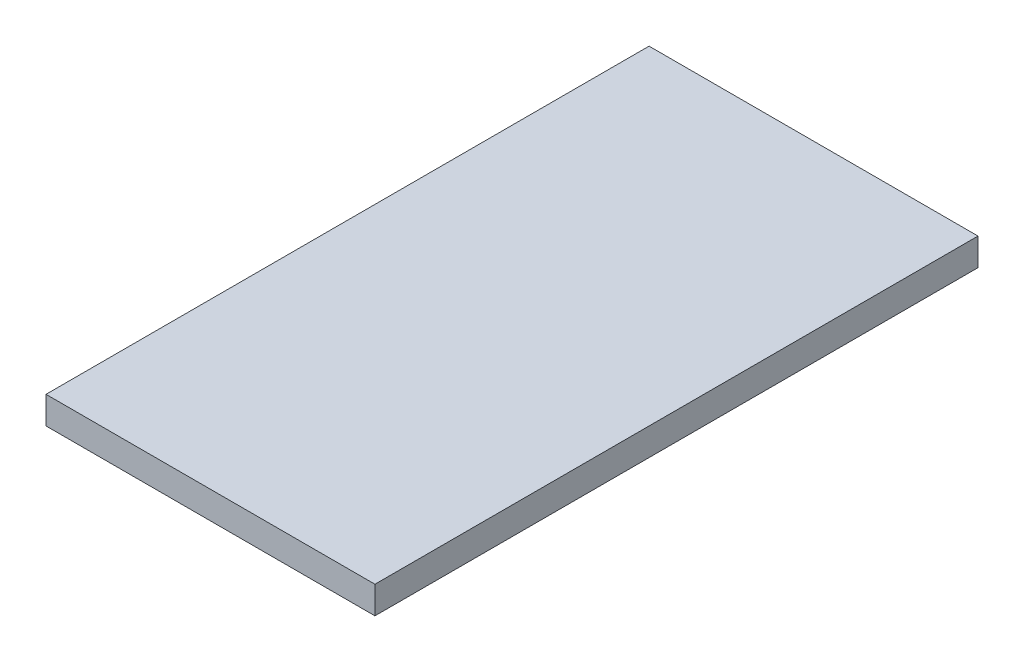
from build123d import *

# Parameters (mm, degrees)
SKETCH1_W      = 60
SKETCH1_H      = 110
EXTRUDE1_DEPTH = 5


with BuildPart() as part:
    # Sketch1 → Extrude1 (new body)
    with BuildSketch(Plane(origin=(0, 0, 0), x_dir=(1, 0, 0), z_dir=(0, 1, 0))):
        with Locations((30, 55)):
            Rectangle(SKETCH1_W, SKETCH1_H)
    extrude(amount=EXTRUDE1_DEPTH)


solid = part.part
